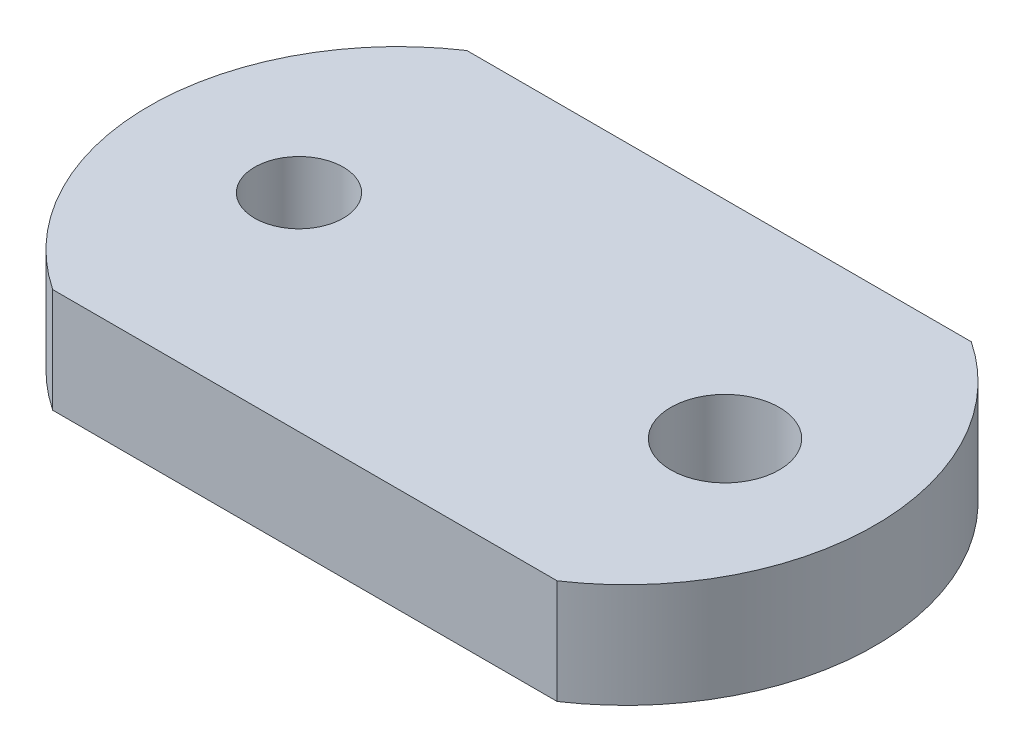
ISO-10303-21;
HEADER;
FILE_DESCRIPTION(('STEP AP214'),'2;1');
FILE_NAME('part.step','',(''),(''),'','','');
FILE_SCHEMA(('AUTOMOTIVE_DESIGN { 1 0 10303 214 1 1 1 1 }'));
ENDSEC;
DATA;
#1=APPLICATION_CONTEXT('core data for automotive mechanical design processes');
#2=APPLICATION_PROTOCOL_DEFINITION('international standard','automotive_design',2000,#1);
#3=PRODUCT_CONTEXT('',#1,'mechanical');
#4=PRODUCT('Part','Part','',(#3));
#5=PRODUCT_RELATED_PRODUCT_CATEGORY('part','',(#4));
#6=PRODUCT_DEFINITION_FORMATION('','',#4);
#7=PRODUCT_DEFINITION_CONTEXT('part definition',#1,'design');
#8=PRODUCT_DEFINITION('design','',#6,#7);
#9=PRODUCT_DEFINITION_SHAPE('','',#8);
#10=(LENGTH_UNIT() NAMED_UNIT(*) SI_UNIT(.MILLI.,.METRE.));
#11=(NAMED_UNIT(*) PLANE_ANGLE_UNIT() SI_UNIT($,.RADIAN.));
#12=(NAMED_UNIT(*) SI_UNIT($,.STERADIAN.) SOLID_ANGLE_UNIT());
#13=UNCERTAINTY_MEASURE_WITH_UNIT(LENGTH_MEASURE(1.E-05),#10,'distance_accuracy_value','');
#14=(GEOMETRIC_REPRESENTATION_CONTEXT(3) GLOBAL_UNCERTAINTY_ASSIGNED_CONTEXT((#13)) GLOBAL_UNIT_ASSIGNED_CONTEXT((#10,
#11,#12)) REPRESENTATION_CONTEXT('',''));
#15=CARTESIAN_POINT('',(0.,0.,0.));
#16=DIRECTION('',(0.,0.,1.));
#17=DIRECTION('',(1.,0.,0.));
#18=AXIS2_PLACEMENT_3D('',#15,#16,#17);
#19=CARTESIAN_POINT('',(5.1011503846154,2.3368,0.));
#20=DIRECTION('',(0.,-1.,0.));
#21=DIRECTION('',(0.,0.,-1.));
#22=AXIS2_PLACEMENT_3D('',#19,#20,#21);
#23=CYLINDRICAL_SURFACE('',#22,11.1294496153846);
#24=CARTESIAN_POINT('',(5.1011503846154,-2.3368,0.));
#25=DIRECTION('',(0.,1.,0.));
#26=DIRECTION('',(0.,0.,-1.));
#27=AXIS2_PLACEMENT_3D('',#24,#25,#26);
#28=CIRCLE('',#27,11.1294496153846);
#29=CARTESIAN_POINT('',(11.2776,-2.3368,9.25829999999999));
#30=VERTEX_POINT('',#29);
#31=CARTESIAN_POINT('',(11.2776,-2.3368,-9.25830000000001));
#32=VERTEX_POINT('',#31);
#33=EDGE_CURVE('E98',#30,#32,#28,.T.);
#34=ORIENTED_EDGE('',*,*,#33,.T.);
#35=DIRECTION('',(0.,-1.,0.));
#36=VECTOR('',#35,1.);
#37=CARTESIAN_POINT('',(11.2776,2.3368,-9.25830000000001));
#38=LINE('',#37,#36);
#39=CARTESIAN_POINT('',(11.2776,2.3368,-9.25830000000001));
#40=VERTEX_POINT('',#39);
#41=EDGE_CURVE('E11',#40,#32,#38,.T.);
#42=ORIENTED_EDGE('',*,*,#41,.F.);
#43=CARTESIAN_POINT('',(5.1011503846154,2.3368,0.));
#44=DIRECTION('',(0.,1.,0.));
#45=DIRECTION('',(0.,0.,-1.));
#46=AXIS2_PLACEMENT_3D('',#43,#44,#45);
#47=CIRCLE('',#46,11.1294496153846);
#48=CARTESIAN_POINT('',(11.2776,2.3368,9.25829999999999));
#49=VERTEX_POINT('',#48);
#50=EDGE_CURVE('E86',#49,#40,#47,.T.);
#51=ORIENTED_EDGE('',*,*,#50,.F.);
#52=DIRECTION('',(0.,-1.,0.));
#53=VECTOR('',#52,1.);
#54=CARTESIAN_POINT('',(11.2776,2.3368,9.25829999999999));
#55=LINE('',#54,#53);
#56=EDGE_CURVE('E94',#49,#30,#55,.T.);
#57=ORIENTED_EDGE('',*,*,#56,.T.);
#58=EDGE_LOOP('',(#34,#42,#51,#57));
#59=FACE_BOUND('',#58,.T.);
#60=ADVANCED_FACE('F35',(#59),#23,.T.);
#61=CARTESIAN_POINT('',(-11.2776,2.3368,-9.25830000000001));
#62=DIRECTION('',(0.,0.,1.));
#63=DIRECTION('',(1.,0.,0.));
#64=AXIS2_PLACEMENT_3D('',#61,#62,#63);
#65=PLANE('',#64);
#66=DIRECTION('',(-1.,0.,0.));
#67=VECTOR('',#66,1.);
#68=CARTESIAN_POINT('',(-11.2776,-2.3368,-9.25830000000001));
#69=LINE('',#68,#67);
#70=CARTESIAN_POINT('',(-11.2776,-2.3368,-9.25830000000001));
#71=VERTEX_POINT('',#70);
#72=EDGE_CURVE('E90',#32,#71,#69,.T.);
#73=ORIENTED_EDGE('',*,*,#72,.T.);
#74=DIRECTION('',(0.,-1.,0.));
#75=VECTOR('',#74,1.);
#76=CARTESIAN_POINT('',(-11.2776,2.3368,-9.25830000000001));
#77=LINE('',#76,#75);
#78=CARTESIAN_POINT('',(-11.2776,2.3368,-9.25830000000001));
#79=VERTEX_POINT('',#78);
#80=EDGE_CURVE('E43',#79,#71,#77,.T.);
#81=ORIENTED_EDGE('',*,*,#80,.F.);
#82=DIRECTION('',(-1.,0.,0.));
#83=VECTOR('',#82,1.);
#84=CARTESIAN_POINT('',(-11.2776,2.3368,-9.25830000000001));
#85=LINE('',#84,#83);
#86=EDGE_CURVE('E81',#40,#79,#85,.T.);
#87=ORIENTED_EDGE('',*,*,#86,.F.);
#88=ORIENTED_EDGE('',*,*,#41,.T.);
#89=EDGE_LOOP('',(#73,#81,#87,#88));
#90=FACE_BOUND('',#89,.T.);
#91=ADVANCED_FACE('F89',(#90),#65,.F.);
#92=CARTESIAN_POINT('',(-5.1011503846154,2.3368,0.));
#93=DIRECTION('',(0.,-1.,0.));
#94=DIRECTION('',(0.,0.,-1.));
#95=AXIS2_PLACEMENT_3D('',#92,#93,#94);
#96=CYLINDRICAL_SURFACE('',#95,11.1294496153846);
#97=CARTESIAN_POINT('',(-5.1011503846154,-2.3368,0.));
#98=DIRECTION('',(0.,1.,0.));
#99=DIRECTION('',(0.,0.,1.));
#100=AXIS2_PLACEMENT_3D('',#97,#98,#99);
#101=CIRCLE('',#100,11.1294496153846);
#102=CARTESIAN_POINT('',(-11.2776,-2.3368,9.25829999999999));
#103=VERTEX_POINT('',#102);
#104=EDGE_CURVE('E68',#71,#103,#101,.T.);
#105=ORIENTED_EDGE('',*,*,#104,.T.);
#106=DIRECTION('',(0.,-1.,0.));
#107=VECTOR('',#106,1.);
#108=CARTESIAN_POINT('',(-11.2776,2.3368,9.25829999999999));
#109=LINE('',#108,#107);
#110=CARTESIAN_POINT('',(-11.2776,2.3368,9.25829999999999));
#111=VERTEX_POINT('',#110);
#112=EDGE_CURVE('E91',#111,#103,#109,.T.);
#113=ORIENTED_EDGE('',*,*,#112,.F.);
#114=CARTESIAN_POINT('',(-5.1011503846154,2.3368,0.));
#115=DIRECTION('',(0.,1.,0.));
#116=DIRECTION('',(0.,0.,1.));
#117=AXIS2_PLACEMENT_3D('',#114,#115,#116);
#118=CIRCLE('',#117,11.1294496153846);
#119=EDGE_CURVE('E84',#79,#111,#118,.T.);
#120=ORIENTED_EDGE('',*,*,#119,.F.);
#121=ORIENTED_EDGE('',*,*,#80,.T.);
#122=EDGE_LOOP('',(#105,#113,#120,#121));
#123=FACE_BOUND('',#122,.T.);
#124=ADVANCED_FACE('F92',(#123),#96,.T.);
#125=CARTESIAN_POINT('',(-11.2776,2.3368,9.25829999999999));
#126=DIRECTION('',(0.,0.,-1.));
#127=DIRECTION('',(-1.,0.,0.));
#128=AXIS2_PLACEMENT_3D('',#125,#126,#127);
#129=PLANE('',#128);
#130=DIRECTION('',(1.,0.,0.));
#131=VECTOR('',#130,1.);
#132=CARTESIAN_POINT('',(-11.2776,-2.3368,9.25829999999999));
#133=LINE('',#132,#131);
#134=EDGE_CURVE('E74',#103,#30,#133,.T.);
#135=ORIENTED_EDGE('',*,*,#134,.T.);
#136=ORIENTED_EDGE('',*,*,#56,.F.);
#137=DIRECTION('',(1.,0.,0.));
#138=VECTOR('',#137,1.);
#139=CARTESIAN_POINT('',(-11.2776,2.3368,9.25829999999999));
#140=LINE('',#139,#138);
#141=EDGE_CURVE('E51',#111,#49,#140,.T.);
#142=ORIENTED_EDGE('',*,*,#141,.F.);
#143=ORIENTED_EDGE('',*,*,#112,.T.);
#144=EDGE_LOOP('',(#135,#136,#142,#143));
#145=FACE_BOUND('',#144,.T.);
#146=ADVANCED_FACE('F106',(#145),#129,.F.);
#147=CARTESIAN_POINT('',(5.1011503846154,2.3368,0.));
#148=DIRECTION('',(0.,-1.,0.));
#149=DIRECTION('',(0.,0.,-1.));
#150=AXIS2_PLACEMENT_3D('',#147,#148,#149);
#151=PLANE('',#150);
#152=CARTESIAN_POINT('',(-9.525,2.3368,0.));
#153=DIRECTION('',(0.,1.,0.));
#154=DIRECTION('',(0.,0.,1.));
#155=AXIS2_PLACEMENT_3D('',#152,#153,#154);
#156=CIRCLE('',#155,1.9812);
#157=CARTESIAN_POINT('',(-9.525,2.3368,1.9812));
#158=VERTEX_POINT('',#157);
#159=EDGE_CURVE('E118',#158,#158,#156,.T.);
#160=ORIENTED_EDGE('',*,*,#159,.F.);
#161=EDGE_LOOP('',(#160));
#162=FACE_BOUND('',#161,.T.);
#163=CARTESIAN_POINT('',(9.525,2.3368,0.));
#164=DIRECTION('',(0.,1.,0.));
#165=DIRECTION('',(0.,0.,1.));
#166=AXIS2_PLACEMENT_3D('',#163,#164,#165);
#167=CIRCLE('',#166,2.4257);
#168=CARTESIAN_POINT('',(9.525,2.3368,2.4257));
#169=VERTEX_POINT('',#168);
#170=EDGE_CURVE('E112',#169,#169,#167,.T.);
#171=ORIENTED_EDGE('',*,*,#170,.F.);
#172=EDGE_LOOP('',(#171));
#173=FACE_BOUND('',#172,.T.);
#174=ORIENTED_EDGE('',*,*,#50,.T.);
#175=ORIENTED_EDGE('',*,*,#86,.T.);
#176=ORIENTED_EDGE('',*,*,#119,.T.);
#177=ORIENTED_EDGE('',*,*,#141,.T.);
#178=EDGE_LOOP('',(#174,#175,#176,#177));
#179=FACE_BOUND('',#178,.T.);
#180=ADVANCED_FACE('F82',(#162,#173,#179),#151,.F.);
#181=CARTESIAN_POINT('',(5.1011503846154,-2.3368,0.));
#182=DIRECTION('',(0.,-1.,0.));
#183=DIRECTION('',(0.,0.,-1.));
#184=AXIS2_PLACEMENT_3D('',#181,#182,#183);
#185=PLANE('',#184);
#186=CARTESIAN_POINT('',(-9.525,-2.3368,0.));
#187=DIRECTION('',(0.,1.,0.));
#188=DIRECTION('',(0.,0.,1.));
#189=AXIS2_PLACEMENT_3D('',#186,#187,#188);
#190=CIRCLE('',#189,1.9812);
#191=CARTESIAN_POINT('',(-9.525,-2.3368,1.9812));
#192=VERTEX_POINT('',#191);
#193=EDGE_CURVE('E115',#192,#192,#190,.T.);
#194=ORIENTED_EDGE('',*,*,#193,.T.);
#195=EDGE_LOOP('',(#194));
#196=FACE_BOUND('',#195,.T.);
#197=CARTESIAN_POINT('',(9.525,-2.3368,0.));
#198=DIRECTION('',(0.,1.,0.));
#199=DIRECTION('',(0.,0.,1.));
#200=AXIS2_PLACEMENT_3D('',#197,#198,#199);
#201=CIRCLE('',#200,2.4257);
#202=CARTESIAN_POINT('',(9.525,-2.3368,2.4257));
#203=VERTEX_POINT('',#202);
#204=EDGE_CURVE('E101',#203,#203,#201,.T.);
#205=ORIENTED_EDGE('',*,*,#204,.T.);
#206=EDGE_LOOP('',(#205));
#207=FACE_BOUND('',#206,.T.);
#208=ORIENTED_EDGE('',*,*,#33,.F.);
#209=ORIENTED_EDGE('',*,*,#134,.F.);
#210=ORIENTED_EDGE('',*,*,#104,.F.);
#211=ORIENTED_EDGE('',*,*,#72,.F.);
#212=EDGE_LOOP('',(#208,#209,#210,#211));
#213=FACE_BOUND('',#212,.T.);
#214=ADVANCED_FACE('F109',(#196,#207,#213),#185,.T.);
#215=CARTESIAN_POINT('',(9.525,-2.3368,0.));
#216=DIRECTION('',(0.,1.,0.));
#217=DIRECTION('',(0.,0.,1.));
#218=AXIS2_PLACEMENT_3D('',#215,#216,#217);
#219=CYLINDRICAL_SURFACE('',#218,2.4257);
#220=ORIENTED_EDGE('',*,*,#204,.F.);
#221=EDGE_LOOP('',(#220));
#222=FACE_BOUND('',#221,.T.);
#223=ORIENTED_EDGE('',*,*,#170,.T.);
#224=EDGE_LOOP('',(#223));
#225=FACE_BOUND('',#224,.T.);
#226=ADVANCED_FACE('F129',(#222,#225),#219,.F.);
#227=CARTESIAN_POINT('',(-9.525,-2.3368,0.));
#228=DIRECTION('',(0.,1.,0.));
#229=DIRECTION('',(0.,0.,1.));
#230=AXIS2_PLACEMENT_3D('',#227,#228,#229);
#231=CYLINDRICAL_SURFACE('',#230,1.9812);
#232=ORIENTED_EDGE('',*,*,#193,.F.);
#233=EDGE_LOOP('',(#232));
#234=FACE_BOUND('',#233,.T.);
#235=ORIENTED_EDGE('',*,*,#159,.T.);
#236=EDGE_LOOP('',(#235));
#237=FACE_BOUND('',#236,.T.);
#238=ADVANCED_FACE('F126',(#234,#237),#231,.F.);
#239=CLOSED_SHELL('',(#60,#91,#124,#146,#180,#214,#226,#238));
#240=MANIFOLD_SOLID_BREP('B2',#239);
#241=ADVANCED_BREP_SHAPE_REPRESENTATION('',(#18,#240),#14);
#242=SHAPE_DEFINITION_REPRESENTATION(#9,#241);
ENDSEC;
END-ISO-10303-21;
